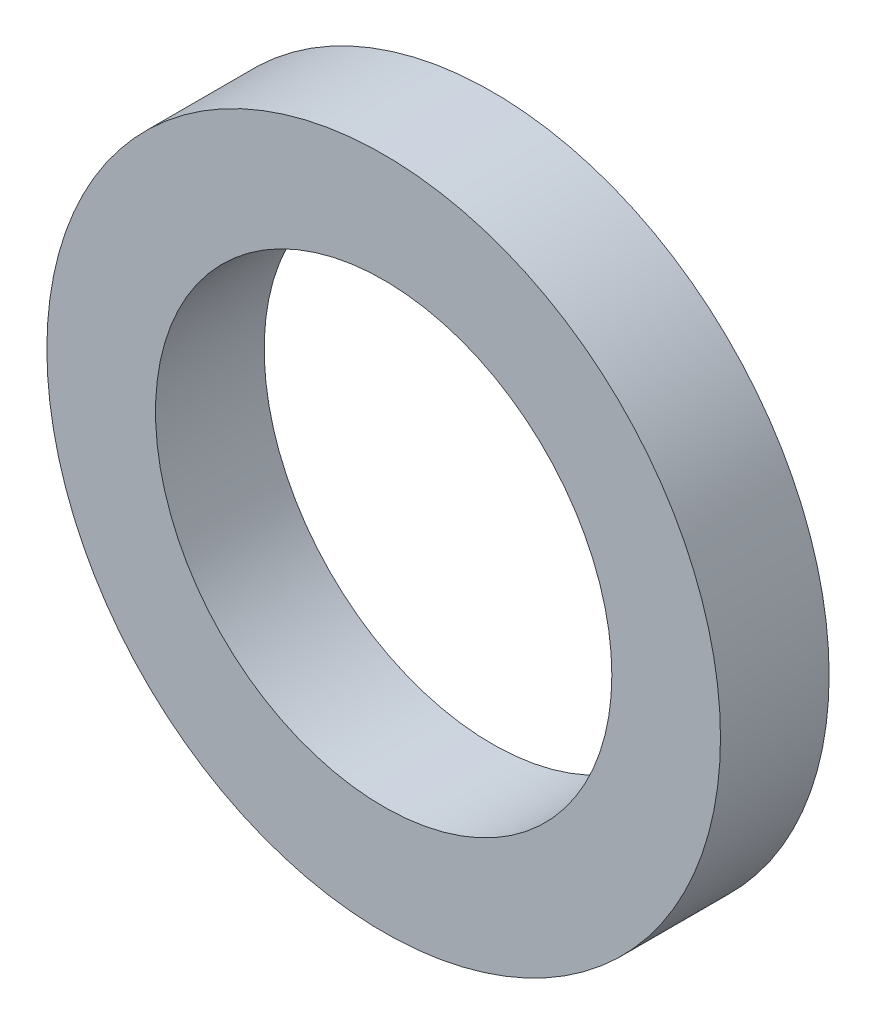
ISO-10303-21;
HEADER;
FILE_DESCRIPTION(('STEP AP214'),'2;1');
FILE_NAME('part.step','',(''),(''),'','','');
FILE_SCHEMA(('AUTOMOTIVE_DESIGN { 1 0 10303 214 1 1 1 1 }'));
ENDSEC;
DATA;
#1=APPLICATION_CONTEXT('core data for automotive mechanical design processes');
#2=APPLICATION_PROTOCOL_DEFINITION('international standard','automotive_design',2000,#1);
#3=PRODUCT_CONTEXT('',#1,'mechanical');
#4=PRODUCT('Part','Part','',(#3));
#5=PRODUCT_RELATED_PRODUCT_CATEGORY('part','',(#4));
#6=PRODUCT_DEFINITION_FORMATION('','',#4);
#7=PRODUCT_DEFINITION_CONTEXT('part definition',#1,'design');
#8=PRODUCT_DEFINITION('design','',#6,#7);
#9=PRODUCT_DEFINITION_SHAPE('','',#8);
#10=(LENGTH_UNIT() NAMED_UNIT(*) SI_UNIT(.MILLI.,.METRE.));
#11=(NAMED_UNIT(*) PLANE_ANGLE_UNIT() SI_UNIT($,.RADIAN.));
#12=(NAMED_UNIT(*) SI_UNIT($,.STERADIAN.) SOLID_ANGLE_UNIT());
#13=UNCERTAINTY_MEASURE_WITH_UNIT(LENGTH_MEASURE(1.E-05),#10,'distance_accuracy_value','');
#14=(GEOMETRIC_REPRESENTATION_CONTEXT(3) GLOBAL_UNCERTAINTY_ASSIGNED_CONTEXT((#13)) GLOBAL_UNIT_ASSIGNED_CONTEXT((#10,
#11,#12)) REPRESENTATION_CONTEXT('',''));
#15=CARTESIAN_POINT('',(0.,0.,0.));
#16=DIRECTION('',(0.,0.,1.));
#17=DIRECTION('',(1.,0.,0.));
#18=AXIS2_PLACEMENT_3D('',#15,#16,#17);
#19=CARTESIAN_POINT('',(0.,0.,5.));
#20=DIRECTION('',(0.,0.,1.));
#21=DIRECTION('',(1.,0.,0.));
#22=AXIS2_PLACEMENT_3D('',#19,#20,#21);
#23=PLANE('',#22);
#24=CARTESIAN_POINT('',(0.,0.,5.));
#25=DIRECTION('',(0.,0.,1.));
#26=DIRECTION('',(1.,0.,0.));
#27=AXIS2_PLACEMENT_3D('',#24,#25,#26);
#28=CIRCLE('',#27,15.5);
#29=CARTESIAN_POINT('',(15.5,0.,5.));
#30=VERTEX_POINT('',#29);
#31=EDGE_CURVE('E8',#30,#30,#28,.T.);
#32=ORIENTED_EDGE('',*,*,#31,.T.);
#33=EDGE_LOOP('',(#32));
#34=FACE_BOUND('',#33,.T.);
#35=CARTESIAN_POINT('',(0.,0.,5.));
#36=DIRECTION('',(0.,0.,1.));
#37=DIRECTION('',(1.,0.,0.));
#38=AXIS2_PLACEMENT_3D('',#35,#36,#37);
#39=CIRCLE('',#38,10.5);
#40=CARTESIAN_POINT('',(10.5,0.,5.));
#41=VERTEX_POINT('',#40);
#42=EDGE_CURVE('E23',#41,#41,#39,.T.);
#43=ORIENTED_EDGE('',*,*,#42,.F.);
#44=EDGE_LOOP('',(#43));
#45=FACE_BOUND('',#44,.T.);
#46=ADVANCED_FACE('F12',(#34,#45),#23,.T.);
#47=CARTESIAN_POINT('',(0.,0.,0.));
#48=DIRECTION('',(0.,0.,1.));
#49=DIRECTION('',(1.,0.,0.));
#50=AXIS2_PLACEMENT_3D('',#47,#48,#49);
#51=PLANE('',#50);
#52=CARTESIAN_POINT('',(0.,0.,0.));
#53=DIRECTION('',(0.,0.,1.));
#54=DIRECTION('',(1.,0.,0.));
#55=AXIS2_PLACEMENT_3D('',#52,#53,#54);
#56=CIRCLE('',#55,15.5);
#57=CARTESIAN_POINT('',(15.5,0.,0.));
#58=VERTEX_POINT('',#57);
#59=EDGE_CURVE('E19',#58,#58,#56,.T.);
#60=ORIENTED_EDGE('',*,*,#59,.F.);
#61=EDGE_LOOP('',(#60));
#62=FACE_BOUND('',#61,.T.);
#63=CARTESIAN_POINT('',(0.,0.,0.));
#64=DIRECTION('',(0.,0.,1.));
#65=DIRECTION('',(1.,0.,0.));
#66=AXIS2_PLACEMENT_3D('',#63,#64,#65);
#67=CIRCLE('',#66,10.5);
#68=CARTESIAN_POINT('',(10.5,0.,0.));
#69=VERTEX_POINT('',#68);
#70=EDGE_CURVE('E27',#69,#69,#67,.T.);
#71=ORIENTED_EDGE('',*,*,#70,.T.);
#72=EDGE_LOOP('',(#71));
#73=FACE_BOUND('',#72,.T.);
#74=ADVANCED_FACE('F33',(#62,#73),#51,.F.);
#75=CARTESIAN_POINT('',(0.,0.,5.));
#76=DIRECTION('',(0.,0.,-1.));
#77=DIRECTION('',(-1.,0.,0.));
#78=AXIS2_PLACEMENT_3D('',#75,#76,#77);
#79=CYLINDRICAL_SURFACE('',#78,15.5);
#80=ORIENTED_EDGE('',*,*,#31,.F.);
#81=EDGE_LOOP('',(#80));
#82=FACE_BOUND('',#81,.T.);
#83=ORIENTED_EDGE('',*,*,#59,.T.);
#84=EDGE_LOOP('',(#83));
#85=FACE_BOUND('',#84,.T.);
#86=ADVANCED_FACE('F14',(#82,#85),#79,.T.);
#87=CARTESIAN_POINT('',(0.,0.,5.));
#88=DIRECTION('',(0.,0.,-1.));
#89=DIRECTION('',(-1.,0.,0.));
#90=AXIS2_PLACEMENT_3D('',#87,#88,#89);
#91=CYLINDRICAL_SURFACE('',#90,10.5);
#92=ORIENTED_EDGE('',*,*,#42,.T.);
#93=EDGE_LOOP('',(#92));
#94=FACE_BOUND('',#93,.T.);
#95=ORIENTED_EDGE('',*,*,#70,.F.);
#96=EDGE_LOOP('',(#95));
#97=FACE_BOUND('',#96,.T.);
#98=ADVANCED_FACE('F35',(#94,#97),#91,.F.);
#99=CLOSED_SHELL('',(#46,#74,#86,#98));
#100=MANIFOLD_SOLID_BREP('B1',#99);
#101=ADVANCED_BREP_SHAPE_REPRESENTATION('',(#18,#100),#14);
#102=SHAPE_DEFINITION_REPRESENTATION(#9,#101);
ENDSEC;
END-ISO-10303-21;
